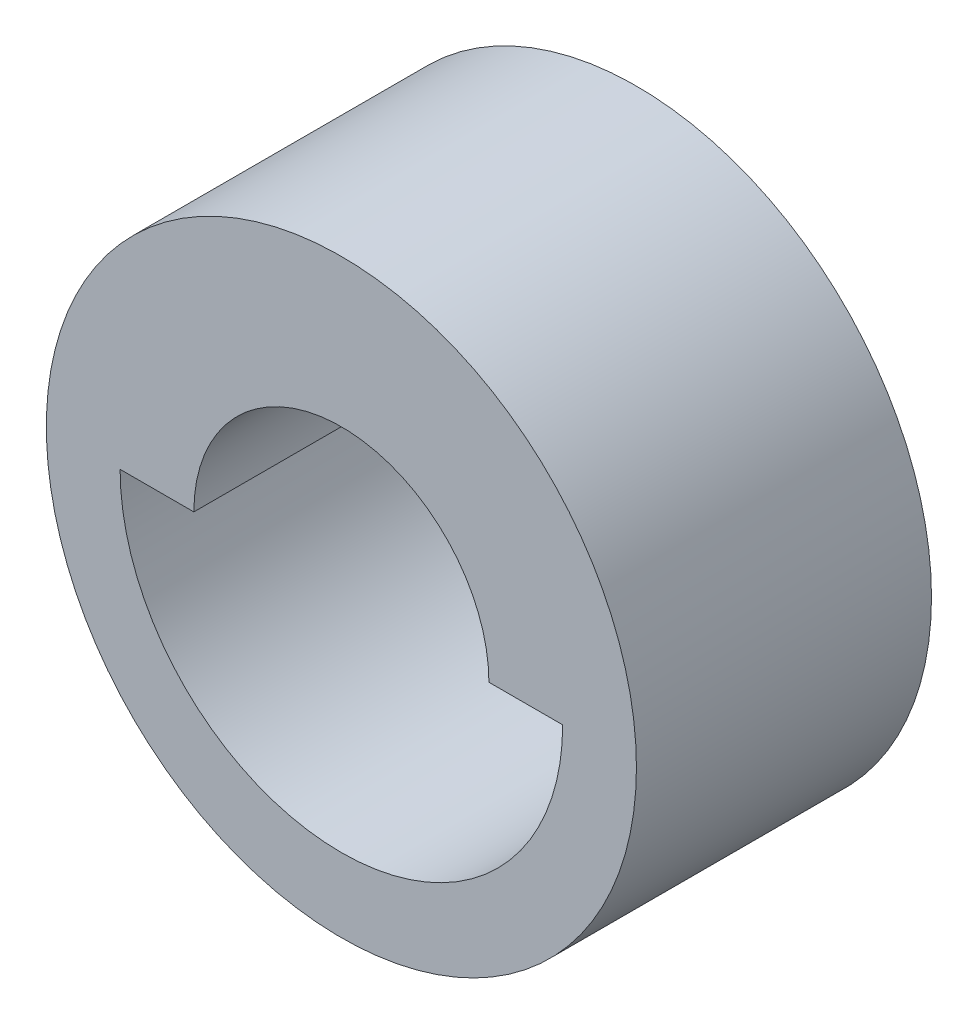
from build123d import *

# Parameters (mm, degrees)
SKETCH1_R           = 50.8
SKETCH1_R_2         = 25.4
BOSS_EXTRUDE1_DEPTH = 50.8
SKETCH2_W           = 12.7
SKETCH2_H           = 50.8
CUT_REVOLVE1_ANGLE  = 180


with BuildPart() as part:
    # Sketch1 → Boss-Extrude1 (new body)
    with BuildSketch(Plane.XY):
        Circle(SKETCH1_R)
        Circle(SKETCH1_R_2, mode=Mode.SUBTRACT)
    extrude(amount=BOSS_EXTRUDE1_DEPTH)

    # Sketch2 → Cut-Revolve1 (revolve, cut)
    with BuildSketch(Plane(origin=(0, 0, 0), x_dir=(1, 0, 0), z_dir=(0, 1, 0))):
        with Locations((31.75, -25.4)):
            Rectangle(SKETCH2_W, SKETCH2_H)
    revolve(axis=Axis((0, 0, 65.280578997), (0, 0, -1)), revolution_arc=CUT_REVOLVE1_ANGLE, mode=Mode.SUBTRACT)


solid = part.part
